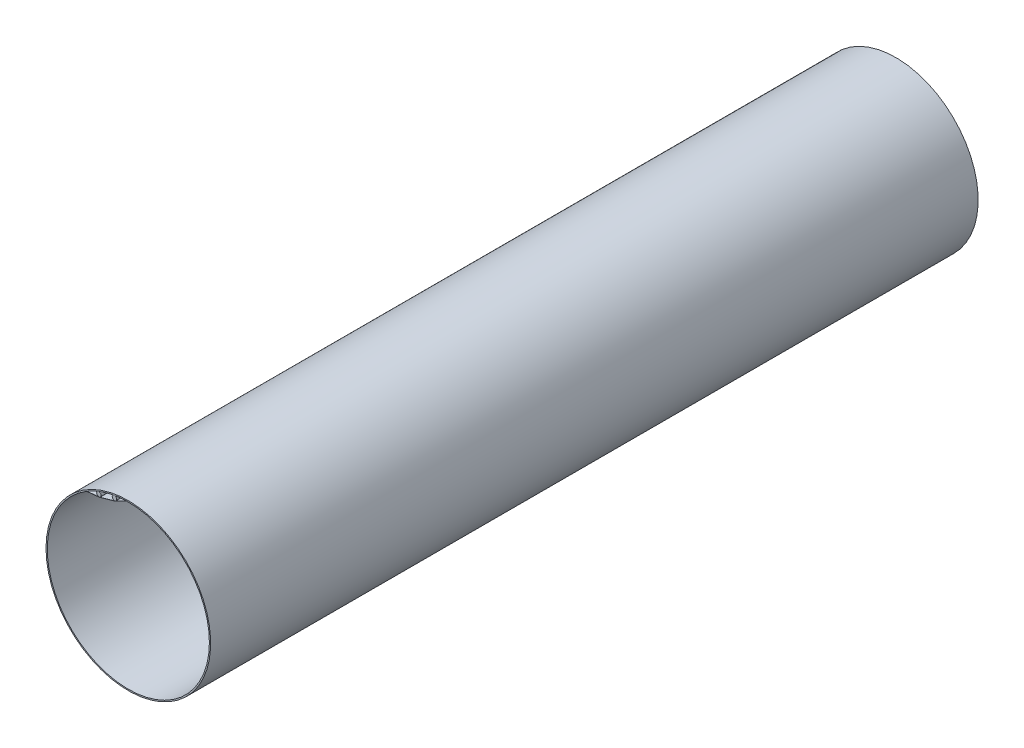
ISO-10303-21;
HEADER;
FILE_DESCRIPTION(('STEP AP214'),'2;1');
FILE_NAME('part.step','',(''),(''),'','','');
FILE_SCHEMA(('AUTOMOTIVE_DESIGN { 1 0 10303 214 1 1 1 1 }'));
ENDSEC;
DATA;
#1=APPLICATION_CONTEXT('core data for automotive mechanical design processes');
#2=APPLICATION_PROTOCOL_DEFINITION('international standard','automotive_design',2000,#1);
#3=PRODUCT_CONTEXT('',#1,'mechanical');
#4=PRODUCT('Part','Part','',(#3));
#5=PRODUCT_RELATED_PRODUCT_CATEGORY('part','',(#4));
#6=PRODUCT_DEFINITION_FORMATION('','',#4);
#7=PRODUCT_DEFINITION_CONTEXT('part definition',#1,'design');
#8=PRODUCT_DEFINITION('design','',#6,#7);
#9=PRODUCT_DEFINITION_SHAPE('','',#8);
#10=(LENGTH_UNIT() NAMED_UNIT(*) SI_UNIT(.MILLI.,.METRE.));
#11=(NAMED_UNIT(*) PLANE_ANGLE_UNIT() SI_UNIT($,.RADIAN.));
#12=(NAMED_UNIT(*) SI_UNIT($,.STERADIAN.) SOLID_ANGLE_UNIT());
#13=UNCERTAINTY_MEASURE_WITH_UNIT(LENGTH_MEASURE(1.E-05),#10,'distance_accuracy_value','');
#14=(GEOMETRIC_REPRESENTATION_CONTEXT(3) GLOBAL_UNCERTAINTY_ASSIGNED_CONTEXT((#13)) GLOBAL_UNIT_ASSIGNED_CONTEXT((#10,
#11,#12)) REPRESENTATION_CONTEXT('',''));
#15=CARTESIAN_POINT('',(0.,0.,0.));
#16=DIRECTION('',(0.,0.,1.));
#17=DIRECTION('',(1.,0.,0.));
#18=AXIS2_PLACEMENT_3D('',#15,#16,#17);
#19=CARTESIAN_POINT('',(-167.02961654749,416.032406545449,8.88178419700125E-13));
#20=DIRECTION('',(0.,0.,-1.));
#21=DIRECTION('',(-1.,0.,0.));
#22=AXIS2_PLACEMENT_3D('',#19,#20,#21);
#23=CYLINDRICAL_SURFACE('',#22,12.7);
#24=CARTESIAN_POINT('',(-167.02961654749,416.032406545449,8.88178419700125E-13));
#25=DIRECTION('',(0.,0.,-1.));
#26=DIRECTION('',(-1.,0.,0.));
#27=AXIS2_PLACEMENT_3D('',#24,#25,#26);
#28=CIRCLE('',#27,12.7);
#29=CARTESIAN_POINT('',(-179.72961654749,416.032406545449,8.88178419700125E-13));
#30=VERTEX_POINT('',#29);
#31=EDGE_CURVE('E11',#30,#30,#28,.T.);
#32=ORIENTED_EDGE('',*,*,#31,.T.);
#33=EDGE_LOOP('',(#32));
#34=FACE_BOUND('',#33,.T.);
#35=CARTESIAN_POINT('',(-167.02961654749,416.032406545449,-4365.0916));
#36=DIRECTION('',(0.,0.,-1.));
#37=DIRECTION('',(-1.,0.,0.));
#38=AXIS2_PLACEMENT_3D('',#35,#36,#37);
#39=CIRCLE('',#38,12.7);
#40=CARTESIAN_POINT('',(-179.72961654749,416.032406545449,-4365.0916));
#41=VERTEX_POINT('',#40);
#42=EDGE_CURVE('E40',#41,#41,#39,.T.);
#43=ORIENTED_EDGE('',*,*,#42,.F.);
#44=EDGE_LOOP('',(#43));
#45=FACE_BOUND('',#44,.T.);
#46=ADVANCED_FACE('F37',(#34,#45),#23,.T.);
#47=CARTESIAN_POINT('',(-167.02961654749,416.032406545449,8.88178419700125E-13));
#48=DIRECTION('',(0.,0.,-1.));
#49=DIRECTION('',(-1.,0.,0.));
#50=AXIS2_PLACEMENT_3D('',#47,#48,#49);
#51=PLANE('',#50);
#52=ORIENTED_EDGE('',*,*,#31,.F.);
#53=EDGE_LOOP('',(#52));
#54=FACE_BOUND('',#53,.T.);
#55=ADVANCED_FACE('F52',(#54),#51,.F.);
#56=CARTESIAN_POINT('',(-167.02961654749,416.032406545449,-4365.0916));
#57=DIRECTION('',(0.,0.,-1.));
#58=DIRECTION('',(-1.,0.,0.));
#59=AXIS2_PLACEMENT_3D('',#56,#57,#58);
#60=PLANE('',#59);
#61=ORIENTED_EDGE('',*,*,#42,.T.);
#62=EDGE_LOOP('',(#61));
#63=FACE_BOUND('',#62,.T.);
#64=ADVANCED_FACE('F49',(#63),#60,.T.);
#65=CLOSED_SHELL('',(#46,#55,#64));
#66=MANIFOLD_SOLID_BREP('B2',#65);
#67=CARTESIAN_POINT('',(-78.8144384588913,441.327701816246,8.88178419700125E-13));
#68=DIRECTION('',(0.,0.,-1.));
#69=DIRECTION('',(-1.,0.,0.));
#70=AXIS2_PLACEMENT_3D('',#67,#68,#69);
#71=CYLINDRICAL_SURFACE('',#70,12.7);
#72=CARTESIAN_POINT('',(-78.8144384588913,441.327701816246,8.88178419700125E-13));
#73=DIRECTION('',(0.,0.,-1.));
#74=DIRECTION('',(-1.,0.,0.));
#75=AXIS2_PLACEMENT_3D('',#72,#73,#74);
#76=CIRCLE('',#75,12.7);
#77=CARTESIAN_POINT('',(-91.5144384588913,441.327701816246,8.88178419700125E-13));
#78=VERTEX_POINT('',#77);
#79=EDGE_CURVE('E36',#78,#78,#76,.T.);
#80=ORIENTED_EDGE('',*,*,#79,.T.);
#81=EDGE_LOOP('',(#80));
#82=FACE_BOUND('',#81,.T.);
#83=CARTESIAN_POINT('',(-78.8144384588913,441.327701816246,-4365.0916));
#84=DIRECTION('',(0.,0.,-1.));
#85=DIRECTION('',(-1.,0.,0.));
#86=AXIS2_PLACEMENT_3D('',#83,#84,#85);
#87=CIRCLE('',#86,12.7);
#88=CARTESIAN_POINT('',(-91.5144384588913,441.327701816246,-4365.0916));
#89=VERTEX_POINT('',#88);
#90=EDGE_CURVE('E89',#89,#89,#87,.T.);
#91=ORIENTED_EDGE('',*,*,#90,.F.);
#92=EDGE_LOOP('',(#91));
#93=FACE_BOUND('',#92,.T.);
#94=ADVANCED_FACE('F86',(#82,#93),#71,.T.);
#95=CARTESIAN_POINT('',(-78.8144384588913,441.327701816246,8.88178419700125E-13));
#96=DIRECTION('',(0.,0.,-1.));
#97=DIRECTION('',(-1.,0.,0.));
#98=AXIS2_PLACEMENT_3D('',#95,#96,#97);
#99=PLANE('',#98);
#100=ORIENTED_EDGE('',*,*,#79,.F.);
#101=EDGE_LOOP('',(#100));
#102=FACE_BOUND('',#101,.T.);
#103=ADVANCED_FACE('F101',(#102),#99,.F.);
#104=CARTESIAN_POINT('',(-78.8144384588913,441.327701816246,-4365.0916));
#105=DIRECTION('',(0.,0.,-1.));
#106=DIRECTION('',(-1.,0.,0.));
#107=AXIS2_PLACEMENT_3D('',#104,#105,#106);
#108=PLANE('',#107);
#109=ORIENTED_EDGE('',*,*,#90,.T.);
#110=EDGE_LOOP('',(#109));
#111=FACE_BOUND('',#110,.T.);
#112=ADVANCED_FACE('F98',(#111),#108,.T.);
#113=CLOSED_SHELL('',(#94,#103,#112));
#114=MANIFOLD_SOLID_BREP('B6',#113);
#115=CARTESIAN_POINT('',(0.,0.,0.0101600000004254));
#116=DIRECTION('',(0.,0.,-1.));
#117=DIRECTION('',(-1.,0.,0.));
#118=AXIS2_PLACEMENT_3D('',#115,#116,#117);
#119=CYLINDRICAL_SURFACE('',#118,461.01);
#120=CARTESIAN_POINT('',(0.,0.,-4365.0916));
#121=DIRECTION('',(0.,0.,-1.));
#122=DIRECTION('',(-1.,0.,0.));
#123=AXIS2_PLACEMENT_3D('',#120,#121,#122);
#124=CIRCLE('',#123,461.01);
#125=CARTESIAN_POINT('',(-235.251919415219,396.467848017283,-4365.0916));
#126=VERTEX_POINT('',#125);
#127=CARTESIAN_POINT('',(-10.5910079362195,460.888327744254,-4365.0916));
#128=VERTEX_POINT('',#127);
#129=EDGE_CURVE('E216',#126,#128,#124,.T.);
#130=ORIENTED_EDGE('',*,*,#129,.T.);
#131=DIRECTION('',(0.,0.,-1.));
#132=VECTOR('',#131,1.);
#133=CARTESIAN_POINT('',(-10.5910079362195,460.888327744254,237.169960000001));
#134=LINE('',#133,#132);
#135=CARTESIAN_POINT('',(-10.5910079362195,460.888327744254,0.0101600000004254));
#136=VERTEX_POINT('',#135);
#137=EDGE_CURVE('E235',#136,#128,#134,.T.);
#138=ORIENTED_EDGE('',*,*,#137,.F.);
#139=CARTESIAN_POINT('',(0.,0.,0.0101600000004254));
#140=DIRECTION('',(0.,0.,-1.));
#141=DIRECTION('',(-1.,0.,0.));
#142=AXIS2_PLACEMENT_3D('',#139,#140,#141);
#143=CIRCLE('',#142,461.01);
#144=CARTESIAN_POINT('',(-235.251919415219,396.467848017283,0.0101600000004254));
#145=VERTEX_POINT('',#144);
#146=EDGE_CURVE('E223',#145,#136,#143,.T.);
#147=ORIENTED_EDGE('',*,*,#146,.F.);
#148=DIRECTION('',(0.,0.,-1.));
#149=VECTOR('',#148,1.);
#150=CARTESIAN_POINT('',(-235.251919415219,396.467848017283,237.169960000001));
#151=LINE('',#150,#149);
#152=EDGE_CURVE('E149',#145,#126,#151,.T.);
#153=ORIENTED_EDGE('',*,*,#152,.T.);
#154=EDGE_LOOP('',(#130,#138,#147,#153));
#155=FACE_BOUND('',#154,.T.);
#156=ADVANCED_FACE('F126',(#155),#119,.F.);
#157=CARTESIAN_POINT('',(0.,0.,0.0101600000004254));
#158=DIRECTION('',(0.,0.,-1.));
#159=DIRECTION('',(-1.,0.,0.));
#160=AXIS2_PLACEMENT_3D('',#157,#158,#159);
#161=CYLINDRICAL_SURFACE('',#160,468.1982);
#162=CARTESIAN_POINT('',(0.,0.,0.0101600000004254));
#163=DIRECTION('',(0.,0.,-1.));
#164=DIRECTION('',(-1.,0.,0.));
#165=AXIS2_PLACEMENT_3D('',#162,#163,#164);
#166=CIRCLE('',#165,468.1982);
#167=CARTESIAN_POINT('',(-468.1982,0.,0.0101600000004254));
#168=VERTEX_POINT('',#167);
#169=EDGE_CURVE('E84',#168,#168,#166,.T.);
#170=ORIENTED_EDGE('',*,*,#169,.T.);
#171=EDGE_LOOP('',(#170));
#172=FACE_BOUND('',#171,.T.);
#173=CARTESIAN_POINT('',(0.,0.,-4365.0916));
#174=DIRECTION('',(0.,0.,-1.));
#175=DIRECTION('',(-1.,0.,0.));
#176=AXIS2_PLACEMENT_3D('',#173,#174,#175);
#177=CIRCLE('',#176,468.1982);
#178=CARTESIAN_POINT('',(-468.1982,0.,-4365.0916));
#179=VERTEX_POINT('',#178);
#180=EDGE_CURVE('E130',#179,#179,#177,.T.);
#181=ORIENTED_EDGE('',*,*,#180,.F.);
#182=EDGE_LOOP('',(#181));
#183=FACE_BOUND('',#182,.T.);
#184=ADVANCED_FACE('F128',(#172,#183),#161,.T.);
#185=CARTESIAN_POINT('',(0.,0.,0.0101600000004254));
#186=DIRECTION('',(0.,0.,-1.));
#187=DIRECTION('',(-1.,0.,0.));
#188=AXIS2_PLACEMENT_3D('',#185,#186,#187);
#189=PLANE('',#188);
#190=ORIENTED_EDGE('',*,*,#146,.T.);
#191=DIRECTION('',(-0.894724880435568,-0.446617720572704,0.));
#192=VECTOR('',#191,1.);
#193=CARTESIAN_POINT('',(-10.5910079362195,460.888327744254,0.0101600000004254));
#194=LINE('',#193,#192);
#195=CARTESIAN_POINT('',(-75.1786663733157,428.648257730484,0.0101600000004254));
#196=VERTEX_POINT('',#195);
#197=EDGE_CURVE('E220',#136,#196,#194,.T.);
#198=ORIENTED_EDGE('',*,*,#197,.T.);
#199=DIRECTION('',(-0.961261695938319,-0.275637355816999,0.));
#200=VECTOR('',#199,1.);
#201=CARTESIAN_POINT('',(-75.1786663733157,428.648257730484,0.0101600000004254));
#202=LINE('',#201,#200);
#203=CARTESIAN_POINT('',(-163.393844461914,403.352962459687,0.0101600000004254));
#204=VERTEX_POINT('',#203);
#205=EDGE_CURVE('E249',#196,#204,#202,.T.);
#206=ORIENTED_EDGE('',*,*,#205,.T.);
#207=DIRECTION('',(-0.995441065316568,-0.0953786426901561,0.));
#208=VECTOR('',#207,1.);
#209=CARTESIAN_POINT('',(-163.393844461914,403.352962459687,0.0101600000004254));
#210=LINE('',#209,#208);
#211=EDGE_CURVE('E251',#204,#145,#210,.T.);
#212=ORIENTED_EDGE('',*,*,#211,.T.);
#213=EDGE_LOOP('',(#190,#198,#206,#212));
#214=FACE_BOUND('',#213,.T.);
#215=CARTESIAN_POINT('',(-8.80974802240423,460.925816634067,0.0101600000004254));
#216=VERTEX_POINT('',#215);
#217=CARTESIAN_POINT('',(-236.782379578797,395.555716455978,0.0101600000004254));
#218=VERTEX_POINT('',#217);
#219=EDGE_CURVE('E208',#216,#218,#143,.T.);
#220=ORIENTED_EDGE('',*,*,#219,.T.);
#221=DIRECTION('',(0.995441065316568,0.0953786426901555,0.));
#222=VECTOR('',#221,1.);
#223=CARTESIAN_POINT('',(-163.251287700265,402.601131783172,0.0101600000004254));
#224=LINE('',#223,#222);
#225=CARTESIAN_POINT('',(-163.251287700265,402.601131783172,0.0101600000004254));
#226=VERTEX_POINT('',#225);
#227=EDGE_CURVE('E253',#218,#226,#224,.T.);
#228=ORIENTED_EDGE('',*,*,#227,.T.);
#229=DIRECTION('',(0.961261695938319,0.275637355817,0.));
#230=VECTOR('',#229,1.);
#231=CARTESIAN_POINT('',(-74.9011518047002,427.935125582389,0.0101600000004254));
#232=LINE('',#231,#230);
#233=CARTESIAN_POINT('',(-74.9011518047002,427.935125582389,0.0101600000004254));
#234=VERTEX_POINT('',#233);
#235=EDGE_CURVE('E237',#226,#234,#232,.T.);
#236=ORIENTED_EDGE('',*,*,#235,.T.);
#237=DIRECTION('',(0.894724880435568,0.446617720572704,0.));
#238=VECTOR('',#237,1.);
#239=CARTESIAN_POINT('',(-8.80974802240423,460.925816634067,0.0101600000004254));
#240=LINE('',#239,#238);
#241=EDGE_CURVE('E217',#234,#216,#240,.T.);
#242=ORIENTED_EDGE('',*,*,#241,.T.);
#243=EDGE_LOOP('',(#220,#228,#236,#242));
#244=FACE_BOUND('',#243,.T.);
#245=ORIENTED_EDGE('',*,*,#169,.F.);
#246=EDGE_LOOP('',(#245));
#247=FACE_BOUND('',#246,.T.);
#248=ADVANCED_FACE('F257',(#214,#244,#247),#189,.F.);
#249=CARTESIAN_POINT('',(0.,0.,-4365.0916));
#250=DIRECTION('',(0.,0.,-1.));
#251=DIRECTION('',(-1.,0.,0.));
#252=AXIS2_PLACEMENT_3D('',#249,#250,#251);
#253=PLANE('',#252);
#254=CARTESIAN_POINT('',(-8.80974802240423,460.925816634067,-4365.0916));
#255=VERTEX_POINT('',#254);
#256=CARTESIAN_POINT('',(-236.782379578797,395.555716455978,-4365.0916));
#257=VERTEX_POINT('',#256);
#258=EDGE_CURVE('E206',#255,#257,#124,.T.);
#259=ORIENTED_EDGE('',*,*,#258,.F.);
#260=DIRECTION('',(-0.894724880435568,-0.446617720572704,0.));
#261=VECTOR('',#260,1.);
#262=CARTESIAN_POINT('',(-8.80974802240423,460.925816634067,-4365.0916));
#263=LINE('',#262,#261);
#264=CARTESIAN_POINT('',(-74.9011518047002,427.935125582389,-4365.0916));
#265=VERTEX_POINT('',#264);
#266=EDGE_CURVE('E191',#255,#265,#263,.T.);
#267=ORIENTED_EDGE('',*,*,#266,.T.);
#268=DIRECTION('',(-0.961261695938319,-0.275637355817,0.));
#269=VECTOR('',#268,1.);
#270=CARTESIAN_POINT('',(-74.9011518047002,427.935125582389,-4365.0916));
#271=LINE('',#270,#269);
#272=CARTESIAN_POINT('',(-163.251287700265,402.601131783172,-4365.0916));
#273=VERTEX_POINT('',#272);
#274=EDGE_CURVE('E199',#265,#273,#271,.T.);
#275=ORIENTED_EDGE('',*,*,#274,.T.);
#276=DIRECTION('',(-0.995441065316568,-0.0953786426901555,0.));
#277=VECTOR('',#276,1.);
#278=CARTESIAN_POINT('',(-163.251287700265,402.601131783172,-4365.0916));
#279=LINE('',#278,#277);
#280=EDGE_CURVE('E215',#273,#257,#279,.T.);
#281=ORIENTED_EDGE('',*,*,#280,.T.);
#282=EDGE_LOOP('',(#259,#267,#275,#281));
#283=FACE_BOUND('',#282,.T.);
#284=ORIENTED_EDGE('',*,*,#129,.F.);
#285=DIRECTION('',(0.995441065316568,0.0953786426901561,0.));
#286=VECTOR('',#285,1.);
#287=CARTESIAN_POINT('',(-163.393844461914,403.352962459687,-4365.0916));
#288=LINE('',#287,#286);
#289=CARTESIAN_POINT('',(-163.393844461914,403.352962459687,-4365.0916));
#290=VERTEX_POINT('',#289);
#291=EDGE_CURVE('E243',#126,#290,#288,.T.);
#292=ORIENTED_EDGE('',*,*,#291,.T.);
#293=DIRECTION('',(0.961261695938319,0.275637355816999,0.));
#294=VECTOR('',#293,1.);
#295=CARTESIAN_POINT('',(-75.1786663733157,428.648257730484,-4365.0916));
#296=LINE('',#295,#294);
#297=CARTESIAN_POINT('',(-75.1786663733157,428.648257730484,-4365.0916));
#298=VERTEX_POINT('',#297);
#299=EDGE_CURVE('E240',#290,#298,#296,.T.);
#300=ORIENTED_EDGE('',*,*,#299,.T.);
#301=DIRECTION('',(0.894724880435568,0.446617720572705,0.));
#302=VECTOR('',#301,1.);
#303=CARTESIAN_POINT('',(-10.5910079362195,460.888327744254,-4365.0916));
#304=LINE('',#303,#302);
#305=EDGE_CURVE('E209',#298,#128,#304,.T.);
#306=ORIENTED_EDGE('',*,*,#305,.T.);
#307=EDGE_LOOP('',(#284,#292,#300,#306));
#308=FACE_BOUND('',#307,.T.);
#309=ORIENTED_EDGE('',*,*,#180,.T.);
#310=EDGE_LOOP('',(#309));
#311=FACE_BOUND('',#310,.T.);
#312=ADVANCED_FACE('F212',(#283,#308,#311),#253,.T.);
#313=ORIENTED_EDGE('',*,*,#258,.T.);
#314=DIRECTION('',(0.,0.,-1.));
#315=VECTOR('',#314,1.);
#316=CARTESIAN_POINT('',(-236.782379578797,395.555716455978,237.169960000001));
#317=LINE('',#316,#315);
#318=EDGE_CURVE('E228',#218,#257,#317,.T.);
#319=ORIENTED_EDGE('',*,*,#318,.F.);
#320=ORIENTED_EDGE('',*,*,#219,.F.);
#321=DIRECTION('',(0.,0.,-1.));
#322=VECTOR('',#321,1.);
#323=CARTESIAN_POINT('',(-8.80974802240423,460.925816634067,237.169960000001));
#324=LINE('',#323,#322);
#325=EDGE_CURVE('E141',#216,#255,#324,.T.);
#326=ORIENTED_EDGE('',*,*,#325,.T.);
#327=EDGE_LOOP('',(#313,#319,#320,#326));
#328=FACE_BOUND('',#327,.T.);
#329=ADVANCED_FACE('F204',(#328),#119,.F.);
#330=CARTESIAN_POINT('',(-10.5910079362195,460.888327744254,237.169960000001));
#331=DIRECTION('',(-0.446617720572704,0.894724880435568,0.));
#332=DIRECTION('',(-0.894724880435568,-0.446617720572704,0.));
#333=AXIS2_PLACEMENT_3D('',#330,#331,#332);
#334=PLANE('',#333);
#335=ORIENTED_EDGE('',*,*,#197,.F.);
#336=ORIENTED_EDGE('',*,*,#137,.T.);
#337=ORIENTED_EDGE('',*,*,#305,.F.);
#338=DIRECTION('',(0.,0.,-1.));
#339=VECTOR('',#338,1.);
#340=CARTESIAN_POINT('',(-75.1786663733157,428.648257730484,237.169960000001));
#341=LINE('',#340,#339);
#342=EDGE_CURVE('E233',#196,#298,#341,.T.);
#343=ORIENTED_EDGE('',*,*,#342,.F.);
#344=EDGE_LOOP('',(#335,#336,#337,#343));
#345=FACE_BOUND('',#344,.T.);
#346=ADVANCED_FACE('F284',(#345),#334,.T.);
#347=CARTESIAN_POINT('',(-75.1786663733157,428.648257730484,237.169960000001));
#348=DIRECTION('',(-0.275637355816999,0.961261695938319,0.));
#349=DIRECTION('',(-0.961261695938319,-0.275637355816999,0.));
#350=AXIS2_PLACEMENT_3D('',#347,#348,#349);
#351=PLANE('',#350);
#352=ORIENTED_EDGE('',*,*,#205,.F.);
#353=ORIENTED_EDGE('',*,*,#342,.T.);
#354=ORIENTED_EDGE('',*,*,#299,.F.);
#355=DIRECTION('',(0.,0.,-1.));
#356=VECTOR('',#355,1.);
#357=CARTESIAN_POINT('',(-163.393844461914,403.352962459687,237.169960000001));
#358=LINE('',#357,#356);
#359=EDGE_CURVE('E231',#204,#290,#358,.T.);
#360=ORIENTED_EDGE('',*,*,#359,.F.);
#361=EDGE_LOOP('',(#352,#353,#354,#360));
#362=FACE_BOUND('',#361,.T.);
#363=ADVANCED_FACE('F272',(#362),#351,.T.);
#364=CARTESIAN_POINT('',(-163.393844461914,403.352962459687,237.169960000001));
#365=DIRECTION('',(-0.0953786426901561,0.995441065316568,0.));
#366=DIRECTION('',(-0.995441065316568,-0.0953786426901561,0.));
#367=AXIS2_PLACEMENT_3D('',#364,#365,#366);
#368=PLANE('',#367);
#369=ORIENTED_EDGE('',*,*,#211,.F.);
#370=ORIENTED_EDGE('',*,*,#359,.T.);
#371=ORIENTED_EDGE('',*,*,#291,.F.);
#372=ORIENTED_EDGE('',*,*,#152,.F.);
#373=EDGE_LOOP('',(#369,#370,#371,#372));
#374=FACE_BOUND('',#373,.T.);
#375=ADVANCED_FACE('F265',(#374),#368,.T.);
#376=CARTESIAN_POINT('',(-163.251287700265,402.601131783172,237.169960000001));
#377=DIRECTION('',(0.0953786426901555,-0.995441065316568,0.));
#378=DIRECTION('',(0.995441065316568,0.0953786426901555,0.));
#379=AXIS2_PLACEMENT_3D('',#376,#377,#378);
#380=PLANE('',#379);
#381=ORIENTED_EDGE('',*,*,#227,.F.);
#382=ORIENTED_EDGE('',*,*,#318,.T.);
#383=ORIENTED_EDGE('',*,*,#280,.F.);
#384=DIRECTION('',(0.,0.,-1.));
#385=VECTOR('',#384,1.);
#386=CARTESIAN_POINT('',(-163.251287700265,402.601131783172,237.169960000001));
#387=LINE('',#386,#385);
#388=EDGE_CURVE('E226',#226,#273,#387,.T.);
#389=ORIENTED_EDGE('',*,*,#388,.F.);
#390=EDGE_LOOP('',(#381,#382,#383,#389));
#391=FACE_BOUND('',#390,.T.);
#392=ADVANCED_FACE('F263',(#391),#380,.T.);
#393=CARTESIAN_POINT('',(-74.9011518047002,427.935125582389,237.169960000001));
#394=DIRECTION('',(0.275637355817,-0.961261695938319,0.));
#395=DIRECTION('',(0.961261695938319,0.275637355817,0.));
#396=AXIS2_PLACEMENT_3D('',#393,#394,#395);
#397=PLANE('',#396);
#398=ORIENTED_EDGE('',*,*,#235,.F.);
#399=ORIENTED_EDGE('',*,*,#388,.T.);
#400=ORIENTED_EDGE('',*,*,#274,.F.);
#401=DIRECTION('',(0.,0.,-1.));
#402=VECTOR('',#401,1.);
#403=CARTESIAN_POINT('',(-74.9011518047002,427.935125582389,237.169960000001));
#404=LINE('',#403,#402);
#405=EDGE_CURVE('E194',#234,#265,#404,.T.);
#406=ORIENTED_EDGE('',*,*,#405,.F.);
#407=EDGE_LOOP('',(#398,#399,#400,#406));
#408=FACE_BOUND('',#407,.T.);
#409=ADVANCED_FACE('F261',(#408),#397,.T.);
#410=CARTESIAN_POINT('',(-8.80974802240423,460.925816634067,237.169960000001));
#411=DIRECTION('',(0.446617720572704,-0.894724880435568,0.));
#412=DIRECTION('',(0.894724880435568,0.446617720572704,0.));
#413=AXIS2_PLACEMENT_3D('',#410,#411,#412);
#414=PLANE('',#413);
#415=ORIENTED_EDGE('',*,*,#241,.F.);
#416=ORIENTED_EDGE('',*,*,#405,.T.);
#417=ORIENTED_EDGE('',*,*,#266,.F.);
#418=ORIENTED_EDGE('',*,*,#325,.F.);
#419=EDGE_LOOP('',(#415,#416,#417,#418));
#420=FACE_BOUND('',#419,.T.);
#421=ADVANCED_FACE('F192',(#420),#414,.T.);
#422=CLOSED_SHELL('',(#156,#184,#248,#312,#329,#346,#363,#375,#392,#409,#421));
#423=MANIFOLD_SOLID_BREP('B31',#422);
#424=ADVANCED_BREP_SHAPE_REPRESENTATION('',(#18,#66,#114,#423),#14);
#425=SHAPE_DEFINITION_REPRESENTATION(#9,#424);
ENDSEC;
END-ISO-10303-21;
